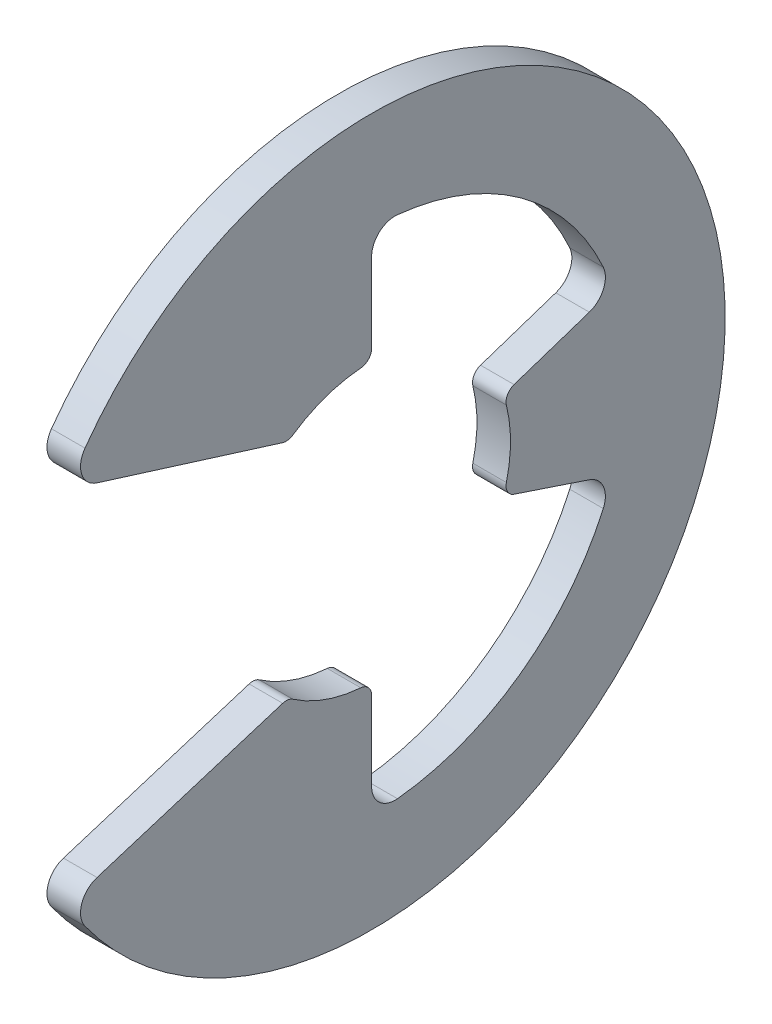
from build123d import *

# Parameters (mm, degrees)
BOSS_EXTRUDE1_DEPTH      = 0.3175
BOSS_EXTRUDE1_DEPTH_BACK = 0.3175
FILLET1_R                = 0.4445
FILLET2_R                = 0.22225


with BuildPart() as part:
    # Sketch3 → Boss-Extrude1 (new, two sides: drawn at the far end of the back side and taken through both)
    with BuildSketch(Plane(origin=(0, 0, 0), x_dir=(0, 0, -1), z_dir=(1, 0, 0)).offset(-BOSS_EXTRUDE1_DEPTH_BACK)):
        with BuildLine():
            Line((2.493993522, -0.831331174), (4.564354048, -1.521451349))
            ThreePointArc((4.564354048, -1.521451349), (2.8131883, -3.903090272), (0, -4.811251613))
            Line((0, -4.811251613), (0, -2.6289))
            ThreePointArc((0, -2.6289), (-0.831331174, -2.493993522), (-1.57734, -2.10312))
            Line((-1.57734, -2.10312), (-5.759367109, -3.409486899))
            ThreePointArc((-5.759367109, -3.409486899), (6.6929, 0), (-5.759367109, 3.409486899))
            Line((-5.759367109, 3.409486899), (-1.57734, 2.10312))
            ThreePointArc((-1.57734, 2.10312), (-0.831331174, 2.493993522), (0, 2.6289))
            Line((0, 2.6289), (0, 4.811251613))
            ThreePointArc((0, 4.811251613), (2.8131883, 3.903090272), (4.564354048, 1.521451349))
            Line((4.564354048, 1.521451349), (2.493993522, 0.831331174))
            ThreePointArc((2.493993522, 0.831331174), (2.6289, 0), (2.493993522, -0.831331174))
        make_face()
    extrude(amount=BOSS_EXTRUDE1_DEPTH + BOSS_EXTRUDE1_DEPTH_BACK)

    # Fillet1
    fillet1_edges = [part.edges().sort_by_distance(p)[0] for p in [
        (0, 1.521451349, -4.564354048),
        (0, 4.811251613, 0),
        (0, 3.409486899, 5.759367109),
        (0, -3.409486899, 5.759367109),
        (0, -4.811251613, 0),
        (0, -1.521451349, -4.564354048),
    ]]
    fillet(fillet1_edges, radius=FILLET1_R)

    # Fillet2
    fillet2_edges = [part.edges().sort_by_distance(p)[0] for p in [
        (0, 0.831331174, -2.493993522),
        (0, 2.6289, 0),
        (0, 2.10312, 1.57734),
        (0, -2.10312, 1.57734),
        (0, -2.6289, 0),
        (0, -0.831331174, -2.493993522),
    ]]
    fillet(fillet2_edges, radius=FILLET2_R)


solid = part.part
